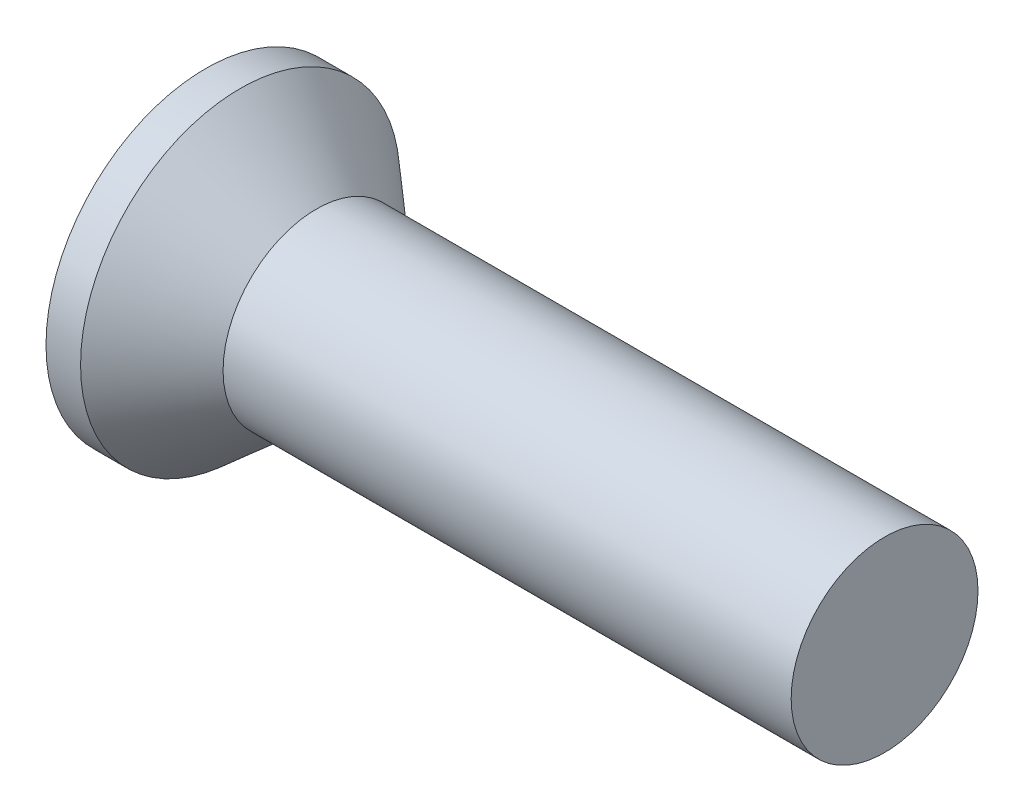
ISO-10303-21;
HEADER;
FILE_DESCRIPTION(('STEP AP214'),'2;1');
FILE_NAME('part.step','',(''),(''),'','','');
FILE_SCHEMA(('AUTOMOTIVE_DESIGN { 1 0 10303 214 1 1 1 1 }'));
ENDSEC;
DATA;
#1=APPLICATION_CONTEXT('core data for automotive mechanical design processes');
#2=APPLICATION_PROTOCOL_DEFINITION('international standard','automotive_design',2000,#1);
#3=PRODUCT_CONTEXT('',#1,'mechanical');
#4=PRODUCT('Part','Part','',(#3));
#5=PRODUCT_RELATED_PRODUCT_CATEGORY('part','',(#4));
#6=PRODUCT_DEFINITION_FORMATION('','',#4);
#7=PRODUCT_DEFINITION_CONTEXT('part definition',#1,'design');
#8=PRODUCT_DEFINITION('design','',#6,#7);
#9=PRODUCT_DEFINITION_SHAPE('','',#8);
#10=(LENGTH_UNIT() NAMED_UNIT(*) SI_UNIT(.MILLI.,.METRE.));
#11=(NAMED_UNIT(*) PLANE_ANGLE_UNIT() SI_UNIT($,.RADIAN.));
#12=(NAMED_UNIT(*) SI_UNIT($,.STERADIAN.) SOLID_ANGLE_UNIT());
#13=UNCERTAINTY_MEASURE_WITH_UNIT(LENGTH_MEASURE(1.E-05),#10,'distance_accuracy_value','');
#14=(GEOMETRIC_REPRESENTATION_CONTEXT(3) GLOBAL_UNCERTAINTY_ASSIGNED_CONTEXT((#13)) GLOBAL_UNIT_ASSIGNED_CONTEXT((#10,
#11,#12)) REPRESENTATION_CONTEXT('',''));
#15=CARTESIAN_POINT('',(0.,0.,0.));
#16=DIRECTION('',(0.,0.,1.));
#17=DIRECTION('',(1.,0.,0.));
#18=AXIS2_PLACEMENT_3D('',#15,#16,#17);
#19=CARTESIAN_POINT('',(0.,0.,0.));
#20=DIRECTION('',(-1.,0.,0.));
#21=DIRECTION('',(0.,0.,1.));
#22=AXIS2_PLACEMENT_3D('',#19,#20,#21);
#23=PLANE('',#22);
#24=CARTESIAN_POINT('',(0.,0.,0.));
#25=DIRECTION('',(-1.,0.,0.));
#26=DIRECTION('',(0.,0.,1.));
#27=AXIS2_PLACEMENT_3D('',#24,#25,#26);
#28=CIRCLE('',#27,1.8669);
#29=CARTESIAN_POINT('',(0.,0.,1.8669));
#30=VERTEX_POINT('',#29);
#31=EDGE_CURVE('E35',#30,#30,#28,.T.);
#32=ORIENTED_EDGE('',*,*,#31,.T.);
#33=EDGE_LOOP('',(#32));
#34=FACE_BOUND('',#33,.T.);
#35=DIRECTION('',(0.,1.,0.));
#36=VECTOR('',#35,1.);
#37=CARTESIAN_POINT('',(0.,-1.524,-0.342899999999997));
#38=LINE('',#37,#36);
#39=CARTESIAN_POINT('',(0.,-1.524,-0.342899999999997));
#40=VERTEX_POINT('',#39);
#41=CARTESIAN_POINT('',(0.,-0.342900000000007,-0.3429));
#42=VERTEX_POINT('',#41);
#43=EDGE_CURVE('E131',#40,#42,#38,.T.);
#44=ORIENTED_EDGE('',*,*,#43,.T.);
#45=DIRECTION('',(0.,0.,-1.));
#46=VECTOR('',#45,1.);
#47=CARTESIAN_POINT('',(0.,-0.342900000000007,1.524));
#48=LINE('',#47,#46);
#49=CARTESIAN_POINT('',(0.,-0.342900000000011,-1.524));
#50=VERTEX_POINT('',#49);
#51=EDGE_CURVE('E99',#42,#50,#48,.T.);
#52=ORIENTED_EDGE('',*,*,#51,.T.);
#53=DIRECTION('',(0.,1.,0.));
#54=VECTOR('',#53,1.);
#55=CARTESIAN_POINT('',(0.,-0.342900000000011,-1.524));
#56=LINE('',#55,#54);
#57=CARTESIAN_POINT('',(0.,0.342900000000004,-1.524));
#58=VERTEX_POINT('',#57);
#59=EDGE_CURVE('E109',#50,#58,#56,.T.);
#60=ORIENTED_EDGE('',*,*,#59,.T.);
#61=DIRECTION('',(0.,0.,1.));
#62=VECTOR('',#61,1.);
#63=CARTESIAN_POINT('',(0.,0.342900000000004,-1.524));
#64=LINE('',#63,#62);
#65=CARTESIAN_POINT('',(0.,0.342899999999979,-0.342899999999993));
#66=VERTEX_POINT('',#65);
#67=EDGE_CURVE('E257',#58,#66,#64,.T.);
#68=ORIENTED_EDGE('',*,*,#67,.T.);
#69=CARTESIAN_POINT('',(0.,1.524,-0.342900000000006));
#70=VERTEX_POINT('',#69);
#71=EDGE_CURVE('E134',#66,#70,#38,.T.);
#72=ORIENTED_EDGE('',*,*,#71,.T.);
#73=DIRECTION('',(0.,0.,1.));
#74=VECTOR('',#73,1.);
#75=CARTESIAN_POINT('',(0.,1.524,-0.342900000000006));
#76=LINE('',#75,#74);
#77=CARTESIAN_POINT('',(0.,1.524,0.342899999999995));
#78=VERTEX_POINT('',#77);
#79=EDGE_CURVE('E138',#70,#78,#76,.T.);
#80=ORIENTED_EDGE('',*,*,#79,.T.);
#81=DIRECTION('',(0.,-1.,0.));
#82=VECTOR('',#81,1.);
#83=CARTESIAN_POINT('',(0.,1.524,0.342899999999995));
#84=LINE('',#83,#82);
#85=CARTESIAN_POINT('',(0.,0.342899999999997,0.342900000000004));
#86=VERTEX_POINT('',#85);
#87=EDGE_CURVE('E142',#78,#86,#84,.T.);
#88=ORIENTED_EDGE('',*,*,#87,.T.);
#89=CARTESIAN_POINT('',(0.,0.342899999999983,1.524));
#90=VERTEX_POINT('',#89);
#91=EDGE_CURVE('E110',#86,#90,#64,.T.);
#92=ORIENTED_EDGE('',*,*,#91,.T.);
#93=DIRECTION('',(0.,-1.,0.));
#94=VECTOR('',#93,1.);
#95=CARTESIAN_POINT('',(0.,0.342899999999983,1.524));
#96=LINE('',#95,#94);
#97=CARTESIAN_POINT('',(0.,-0.342900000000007,1.524));
#98=VERTEX_POINT('',#97);
#99=EDGE_CURVE('E248',#90,#98,#96,.T.);
#100=ORIENTED_EDGE('',*,*,#99,.T.);
#101=CARTESIAN_POINT('',(0.,-0.342900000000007,0.342899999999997));
#102=VERTEX_POINT('',#101);
#103=EDGE_CURVE('E256',#98,#102,#48,.T.);
#104=ORIENTED_EDGE('',*,*,#103,.T.);
#105=CARTESIAN_POINT('',(0.,-1.52400000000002,0.342899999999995));
#106=VERTEX_POINT('',#105);
#107=EDGE_CURVE('E141',#102,#106,#84,.T.);
#108=ORIENTED_EDGE('',*,*,#107,.T.);
#109=DIRECTION('',(0.,0.,-1.));
#110=VECTOR('',#109,1.);
#111=CARTESIAN_POINT('',(0.,-1.52400000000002,0.342899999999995));
#112=LINE('',#111,#110);
#113=EDGE_CURVE('E145',#106,#40,#112,.T.);
#114=ORIENTED_EDGE('',*,*,#113,.T.);
#115=EDGE_LOOP('',(#44,#52,#60,#68,#72,#80,#88,#92,#100,#104,#108,#114));
#116=FACE_BOUND('',#115,.T.);
#117=ADVANCED_FACE('F28',(#34,#116),#23,.T.);
#118=CARTESIAN_POINT('',(1.88890140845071,0.,0.149716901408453));
#119=DIRECTION('',(-0.10174201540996,0.,-0.994810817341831));
#120=DIRECTION('',(-0.99481081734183,0.,0.10174201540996));
#121=AXIS2_PLACEMENT_3D('',#118,#119,#120);
#122=PLANE('',#121);
#123=ORIENTED_EDGE('',*,*,#107,.F.);
#124=DIRECTION('',(0.989701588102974,0.101219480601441,-0.10121948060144));
#125=VECTOR('',#124,1.);
#126=CARTESIAN_POINT('',(1.903899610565,-0.148182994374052,0.148182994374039));
#127=LINE('',#126,#125);
#128=CARTESIAN_POINT('',(1.67640000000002,-0.171449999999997,0.171450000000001));
#129=VERTEX_POINT('',#128);
#130=EDGE_CURVE('E128',#102,#129,#127,.T.);
#131=ORIENTED_EDGE('',*,*,#130,.T.);
#132=DIRECTION('',(0.775819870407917,0.625945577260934,-0.0793452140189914));
#133=VECTOR('',#132,1.);
#134=CARTESIAN_POINT('',(0.,-1.52400000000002,0.342899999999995));
#135=LINE('',#134,#133);
#136=EDGE_CURVE('E118',#106,#129,#135,.T.);
#137=ORIENTED_EDGE('',*,*,#136,.F.);
#138=EDGE_LOOP('',(#123,#131,#137));
#139=FACE_BOUND('',#138,.T.);
#140=ADVANCED_FACE('F176',(#139),#122,.T.);
#141=DIRECTION('',(0.775819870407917,-0.625945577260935,-0.0793452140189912));
#142=VECTOR('',#141,1.);
#143=CARTESIAN_POINT('',(0.,1.524,0.342899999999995));
#144=LINE('',#143,#142);
#145=CARTESIAN_POINT('',(1.6764,0.171449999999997,0.171450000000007));
#146=VERTEX_POINT('',#145);
#147=EDGE_CURVE('E42',#78,#146,#144,.T.);
#148=ORIENTED_EDGE('',*,*,#147,.T.);
#149=DIRECTION('',(-0.989701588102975,0.10121948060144,0.10121948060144));
#150=VECTOR('',#149,1.);
#151=CARTESIAN_POINT('',(1.90389961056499,0.148182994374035,0.148182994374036));
#152=LINE('',#151,#150);
#153=EDGE_CURVE('E267',#146,#86,#152,.T.);
#154=ORIENTED_EDGE('',*,*,#153,.T.);
#155=ORIENTED_EDGE('',*,*,#87,.F.);
#156=EDGE_LOOP('',(#148,#154,#155));
#157=FACE_BOUND('',#156,.T.);
#158=ADVANCED_FACE('F181',(#157),#122,.T.);
#159=CARTESIAN_POINT('',(1.88890140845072,0.,-0.149716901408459));
#160=DIRECTION('',(-0.101742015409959,0.,0.994810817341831));
#161=DIRECTION('',(0.99481081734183,0.,0.10174201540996));
#162=AXIS2_PLACEMENT_3D('',#159,#160,#161);
#163=PLANE('',#162);
#164=DIRECTION('',(0.775819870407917,0.625945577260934,0.0793452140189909));
#165=VECTOR('',#164,1.);
#166=CARTESIAN_POINT('',(0.,-1.524,-0.342899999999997));
#167=LINE('',#166,#165);
#168=CARTESIAN_POINT('',(1.67640000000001,-0.17145000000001,-0.171449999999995));
#169=VERTEX_POINT('',#168);
#170=EDGE_CURVE('E50',#40,#169,#167,.T.);
#171=ORIENTED_EDGE('',*,*,#170,.T.);
#172=DIRECTION('',(-0.989701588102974,-0.10121948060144,-0.10121948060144));
#173=VECTOR('',#172,1.);
#174=CARTESIAN_POINT('',(1.903899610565,-0.148182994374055,-0.14818299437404));
#175=LINE('',#174,#173);
#176=EDGE_CURVE('E11',#169,#42,#175,.T.);
#177=ORIENTED_EDGE('',*,*,#176,.T.);
#178=ORIENTED_EDGE('',*,*,#43,.F.);
#179=EDGE_LOOP('',(#171,#177,#178));
#180=FACE_BOUND('',#179,.T.);
#181=ADVANCED_FACE('F130',(#180),#163,.T.);
#182=ORIENTED_EDGE('',*,*,#71,.F.);
#183=DIRECTION('',(0.989701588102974,-0.101219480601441,0.10121948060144));
#184=VECTOR('',#183,1.);
#185=CARTESIAN_POINT('',(1.90389961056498,0.148182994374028,-0.148182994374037));
#186=LINE('',#185,#184);
#187=CARTESIAN_POINT('',(1.6764,0.171450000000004,-0.171449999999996));
#188=VERTEX_POINT('',#187);
#189=EDGE_CURVE('E264',#66,#188,#186,.T.);
#190=ORIENTED_EDGE('',*,*,#189,.T.);
#191=DIRECTION('',(0.775819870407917,-0.625945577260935,0.0793452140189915));
#192=VECTOR('',#191,1.);
#193=CARTESIAN_POINT('',(0.,1.524,-0.342900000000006));
#194=LINE('',#193,#192);
#195=EDGE_CURVE('E121',#70,#188,#194,.T.);
#196=ORIENTED_EDGE('',*,*,#195,.F.);
#197=EDGE_LOOP('',(#182,#190,#196));
#198=FACE_BOUND('',#197,.T.);
#199=ADVANCED_FACE('F164',(#198),#163,.T.);
#200=CARTESIAN_POINT('',(-6.34999999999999,0.,0.));
#201=DIRECTION('',(-1.,0.,0.));
#202=DIRECTION('',(0.,0.,1.));
#203=AXIS2_PLACEMENT_3D('',#200,#201,#202);
#204=CYLINDRICAL_SURFACE('',#203,1.8669);
#205=CARTESIAN_POINT('',(0.404209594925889,0.,0.));
#206=DIRECTION('',(-1.,0.,0.));
#207=DIRECTION('',(0.,0.,1.));
#208=AXIS2_PLACEMENT_3D('',#205,#206,#207);
#209=CIRCLE('',#208,1.8669);
#210=CARTESIAN_POINT('',(0.404209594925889,0.,1.86690000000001));
#211=VERTEX_POINT('',#210);
#212=EDGE_CURVE('E154',#211,#211,#209,.T.);
#213=ORIENTED_EDGE('',*,*,#212,.T.);
#214=EDGE_LOOP('',(#213));
#215=FACE_BOUND('',#214,.T.);
#216=ORIENTED_EDGE('',*,*,#31,.F.);
#217=EDGE_LOOP('',(#216));
#218=FACE_BOUND('',#217,.T.);
#219=ADVANCED_FACE('F161',(#215,#218),#204,.T.);
#220=CARTESIAN_POINT('',(0.404209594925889,0.,0.));
#221=DIRECTION('',(-1.,0.,0.));
#222=DIRECTION('',(0.,0.,1.));
#223=AXIS2_PLACEMENT_3D('',#220,#221,#222);
#224=CONICAL_SURFACE('',#223,1.8669,0.715584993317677);
#225=CARTESIAN_POINT('',(1.2954,0.,0.));
#226=DIRECTION('',(-1.,0.,0.));
#227=DIRECTION('',(0.,0.,1.));
#228=AXIS2_PLACEMENT_3D('',#225,#226,#227);
#229=CIRCLE('',#228,1.0922);
#230=CARTESIAN_POINT('',(1.2954,0.,1.09220000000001));
#231=VERTEX_POINT('',#230);
#232=EDGE_CURVE('E151',#231,#231,#229,.T.);
#233=ORIENTED_EDGE('',*,*,#232,.T.);
#234=EDGE_LOOP('',(#233));
#235=FACE_BOUND('',#234,.T.);
#236=ORIENTED_EDGE('',*,*,#212,.F.);
#237=EDGE_LOOP('',(#236));
#238=FACE_BOUND('',#237,.T.);
#239=ADVANCED_FACE('F163',(#235,#238),#224,.T.);
#240=CARTESIAN_POINT('',(-6.34999999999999,0.,0.));
#241=DIRECTION('',(-1.,0.,0.));
#242=DIRECTION('',(0.,0.,1.));
#243=AXIS2_PLACEMENT_3D('',#240,#241,#242);
#244=CYLINDRICAL_SURFACE('',#243,1.0922);
#245=CARTESIAN_POINT('',(7.9375,0.,0.));
#246=DIRECTION('',(-1.,0.,0.));
#247=DIRECTION('',(0.,0.,1.));
#248=AXIS2_PLACEMENT_3D('',#245,#246,#247);
#249=CIRCLE('',#248,1.0922);
#250=CARTESIAN_POINT('',(7.9375,0.,1.0922));
#251=VERTEX_POINT('',#250);
#252=EDGE_CURVE('E147',#251,#251,#249,.T.);
#253=ORIENTED_EDGE('',*,*,#252,.T.);
#254=EDGE_LOOP('',(#253));
#255=FACE_BOUND('',#254,.T.);
#256=ORIENTED_EDGE('',*,*,#232,.F.);
#257=EDGE_LOOP('',(#256));
#258=FACE_BOUND('',#257,.T.);
#259=ADVANCED_FACE('F169',(#255,#258),#244,.T.);
#260=CARTESIAN_POINT('',(7.9375,1.09219999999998,0.));
#261=DIRECTION('',(1.,0.,0.));
#262=DIRECTION('',(0.,0.,-1.));
#263=AXIS2_PLACEMENT_3D('',#260,#261,#262);
#264=PLANE('',#263);
#265=ORIENTED_EDGE('',*,*,#252,.F.);
#266=EDGE_LOOP('',(#265));
#267=FACE_BOUND('',#266,.T.);
#268=ADVANCED_FACE('F194',(#267),#264,.T.);
#269=CARTESIAN_POINT('',(1.6764,0.171450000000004,-0.171449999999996));
#270=DIRECTION('',(1.,0.,0.));
#271=DIRECTION('',(0.,0.,-1.));
#272=AXIS2_PLACEMENT_3D('',#269,#270,#271);
#273=PLANE('',#272);
#274=DIRECTION('',(0.,1.,0.));
#275=VECTOR('',#274,1.);
#276=CARTESIAN_POINT('',(1.67640000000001,-0.17145000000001,-0.17144999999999));
#277=LINE('',#276,#275);
#278=EDGE_CURVE('E106',#169,#188,#277,.T.);
#279=ORIENTED_EDGE('',*,*,#278,.F.);
#280=DIRECTION('',(0.,0.,-1.));
#281=VECTOR('',#280,1.);
#282=CARTESIAN_POINT('',(1.67640000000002,-0.171450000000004,0.17145000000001));
#283=LINE('',#282,#281);
#284=EDGE_CURVE('E115',#129,#169,#283,.T.);
#285=ORIENTED_EDGE('',*,*,#284,.F.);
#286=DIRECTION('',(0.,-1.,0.));
#287=VECTOR('',#286,1.);
#288=CARTESIAN_POINT('',(1.6764,0.171449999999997,0.171450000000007));
#289=LINE('',#288,#287);
#290=EDGE_CURVE('E122',#146,#129,#289,.T.);
#291=ORIENTED_EDGE('',*,*,#290,.F.);
#292=DIRECTION('',(0.,0.,1.));
#293=VECTOR('',#292,1.);
#294=CARTESIAN_POINT('',(1.6764,0.171450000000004,-0.171449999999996));
#295=LINE('',#294,#293);
#296=EDGE_CURVE('E126',#188,#146,#295,.T.);
#297=ORIENTED_EDGE('',*,*,#296,.F.);
#298=EDGE_LOOP('',(#279,#285,#291,#297));
#299=FACE_BOUND('',#298,.T.);
#300=ADVANCED_FACE('F125',(#299),#273,.F.);
#301=CARTESIAN_POINT('',(0.,-1.524,-0.342899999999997));
#302=DIRECTION('',(-0.627925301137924,0.778273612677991,0.));
#303=DIRECTION('',(-0.778273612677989,-0.627925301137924,0.));
#304=AXIS2_PLACEMENT_3D('',#301,#302,#303);
#305=PLANE('',#304);
#306=ORIENTED_EDGE('',*,*,#170,.F.);
#307=ORIENTED_EDGE('',*,*,#113,.F.);
#308=ORIENTED_EDGE('',*,*,#136,.T.);
#309=ORIENTED_EDGE('',*,*,#284,.T.);
#310=EDGE_LOOP('',(#306,#307,#308,#309));
#311=FACE_BOUND('',#310,.T.);
#312=ADVANCED_FACE('F116',(#311),#305,.T.);
#313=CARTESIAN_POINT('',(1.6764,0.171449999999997,0.171450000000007));
#314=DIRECTION('',(-0.627925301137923,-0.778273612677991,0.));
#315=DIRECTION('',(0.778273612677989,-0.627925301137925,0.));
#316=AXIS2_PLACEMENT_3D('',#313,#314,#315);
#317=PLANE('',#316);
#318=ORIENTED_EDGE('',*,*,#147,.F.);
#319=ORIENTED_EDGE('',*,*,#79,.F.);
#320=ORIENTED_EDGE('',*,*,#195,.T.);
#321=ORIENTED_EDGE('',*,*,#296,.T.);
#322=EDGE_LOOP('',(#318,#319,#320,#321));
#323=FACE_BOUND('',#322,.T.);
#324=ADVANCED_FACE('F193',(#323),#317,.T.);
#325=CARTESIAN_POINT('',(1.88890140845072,-0.149716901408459,0.));
#326=DIRECTION('',(-0.10174201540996,0.994810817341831,0.));
#327=DIRECTION('',(-0.994810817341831,-0.10174201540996,0.));
#328=AXIS2_PLACEMENT_3D('',#325,#326,#327);
#329=PLANE('',#328);
#330=DIRECTION('',(0.775819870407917,0.0793452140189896,0.625945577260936));
#331=VECTOR('',#330,1.);
#332=CARTESIAN_POINT('',(0.,-0.342900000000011,-1.524));
#333=LINE('',#332,#331);
#334=EDGE_CURVE('E97',#50,#169,#333,.T.);
#335=ORIENTED_EDGE('',*,*,#334,.F.);
#336=ORIENTED_EDGE('',*,*,#51,.F.);
#337=ORIENTED_EDGE('',*,*,#176,.F.);
#338=EDGE_LOOP('',(#335,#336,#337));
#339=FACE_BOUND('',#338,.T.);
#340=ADVANCED_FACE('F96',(#339),#329,.T.);
#341=CARTESIAN_POINT('',(1.88890140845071,0.149716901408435,0.));
#342=DIRECTION('',(-0.101742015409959,-0.994810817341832,0.));
#343=DIRECTION('',(0.994810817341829,-0.10174201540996,0.));
#344=AXIS2_PLACEMENT_3D('',#341,#342,#343);
#345=PLANE('',#344);
#346=ORIENTED_EDGE('',*,*,#67,.F.);
#347=DIRECTION('',(0.775819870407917,-0.0793452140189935,0.625945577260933));
#348=VECTOR('',#347,1.);
#349=CARTESIAN_POINT('',(0.,0.342900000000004,-1.524));
#350=LINE('',#349,#348);
#351=EDGE_CURVE('E111',#58,#188,#350,.T.);
#352=ORIENTED_EDGE('',*,*,#351,.T.);
#353=ORIENTED_EDGE('',*,*,#189,.F.);
#354=EDGE_LOOP('',(#346,#352,#353));
#355=FACE_BOUND('',#354,.T.);
#356=ADVANCED_FACE('F227',(#355),#345,.T.);
#357=CARTESIAN_POINT('',(0.,0.342900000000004,-1.524));
#358=DIRECTION('',(-0.627925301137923,0.,0.778273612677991));
#359=DIRECTION('',(-0.778273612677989,0.,-0.627925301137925));
#360=AXIS2_PLACEMENT_3D('',#357,#358,#359);
#361=PLANE('',#360);
#362=ORIENTED_EDGE('',*,*,#351,.F.);
#363=ORIENTED_EDGE('',*,*,#59,.F.);
#364=ORIENTED_EDGE('',*,*,#334,.T.);
#365=ORIENTED_EDGE('',*,*,#278,.T.);
#366=EDGE_LOOP('',(#362,#363,#364,#365));
#367=FACE_BOUND('',#366,.T.);
#368=ADVANCED_FACE('F104',(#367),#361,.T.);
#369=ORIENTED_EDGE('',*,*,#103,.F.);
#370=DIRECTION('',(0.775819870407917,0.0793452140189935,-0.625945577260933));
#371=VECTOR('',#370,1.);
#372=CARTESIAN_POINT('',(0.,-0.342900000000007,1.524));
#373=LINE('',#372,#371);
#374=EDGE_CURVE('E246',#98,#129,#373,.T.);
#375=ORIENTED_EDGE('',*,*,#374,.T.);
#376=ORIENTED_EDGE('',*,*,#130,.F.);
#377=EDGE_LOOP('',(#369,#375,#376));
#378=FACE_BOUND('',#377,.T.);
#379=ADVANCED_FACE('F229',(#378),#329,.T.);
#380=DIRECTION('',(0.775819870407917,-0.0793452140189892,-0.625945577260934));
#381=VECTOR('',#380,1.);
#382=CARTESIAN_POINT('',(0.,0.342899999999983,1.524));
#383=LINE('',#382,#381);
#384=EDGE_CURVE('E252',#90,#146,#383,.T.);
#385=ORIENTED_EDGE('',*,*,#384,.F.);
#386=ORIENTED_EDGE('',*,*,#91,.F.);
#387=ORIENTED_EDGE('',*,*,#153,.F.);
#388=EDGE_LOOP('',(#385,#386,#387));
#389=FACE_BOUND('',#388,.T.);
#390=ADVANCED_FACE('F236',(#389),#345,.T.);
#391=CARTESIAN_POINT('',(1.67640000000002,-0.171449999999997,0.171450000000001));
#392=DIRECTION('',(-0.627925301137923,0.,-0.77827361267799));
#393=DIRECTION('',(0.778273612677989,0.,-0.627925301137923));
#394=AXIS2_PLACEMENT_3D('',#391,#392,#393);
#395=PLANE('',#394);
#396=ORIENTED_EDGE('',*,*,#374,.F.);
#397=ORIENTED_EDGE('',*,*,#99,.F.);
#398=ORIENTED_EDGE('',*,*,#384,.T.);
#399=ORIENTED_EDGE('',*,*,#290,.T.);
#400=EDGE_LOOP('',(#396,#397,#398,#399));
#401=FACE_BOUND('',#400,.T.);
#402=ADVANCED_FACE('F237',(#401),#395,.T.);
#403=CLOSED_SHELL('',(#117,#140,#158,#181,#199,#219,#239,#259,#268,#300,#312,#324,#340,#356,
#368,#379,#390,#402));
#404=MANIFOLD_SOLID_BREP('B2',#403);
#405=ADVANCED_BREP_SHAPE_REPRESENTATION('',(#18,#404),#14);
#406=SHAPE_DEFINITION_REPRESENTATION(#9,#405);
ENDSEC;
END-ISO-10303-21;
